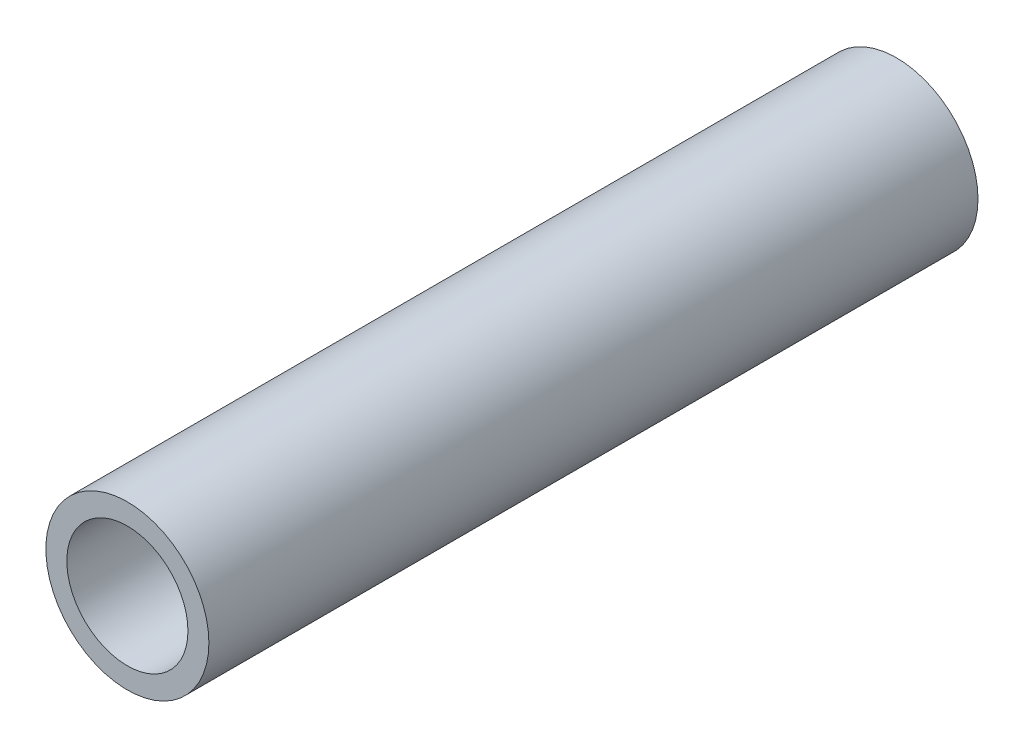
from build123d import *

# Parameters (mm, degrees)
SKETCH1_R           = 10.7696
SKETCH1_R_2         = 8.001
BOSS_EXTRUDE1_DEPTH = 50.8


with BuildPart() as part:
    # Sketch1 → Boss-Extrude1 (new, symmetric)
    with BuildSketch(Plane.XY):
        Circle(SKETCH1_R)
        Circle(SKETCH1_R_2, mode=Mode.SUBTRACT)
    extrude(amount=BOSS_EXTRUDE1_DEPTH, both=True)


solid = part.part
